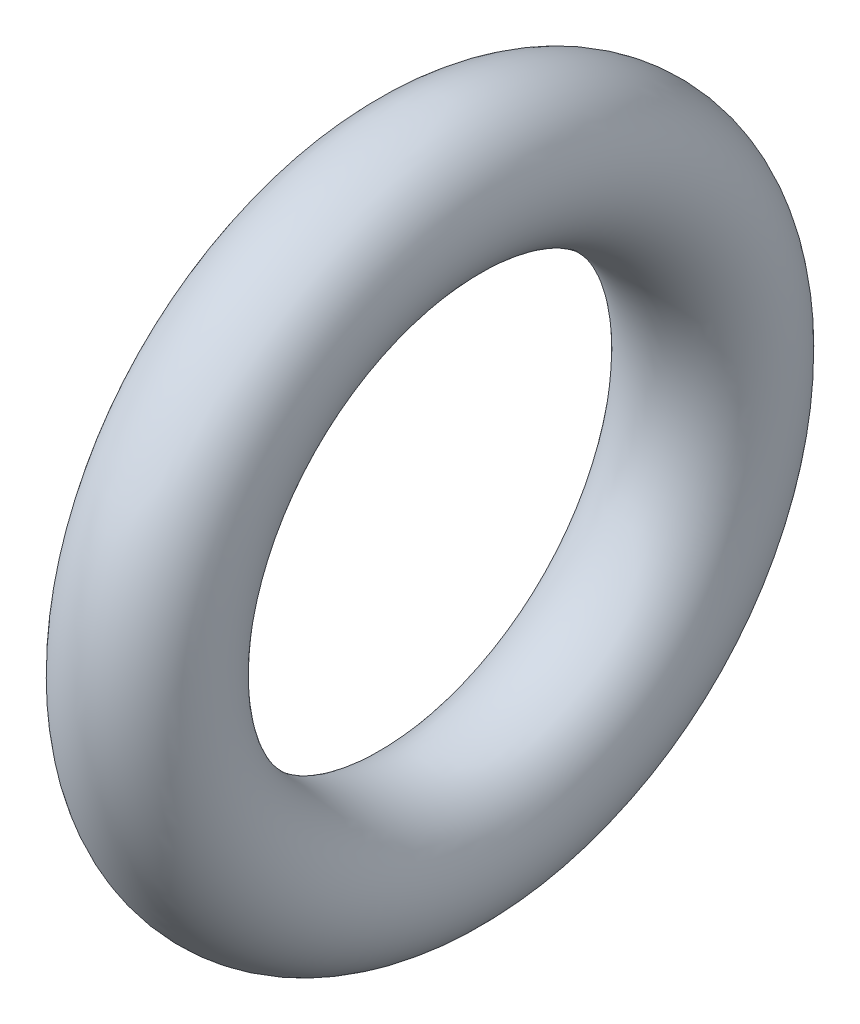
from build123d import *

# Parameters (mm, degrees)
ESQUISSE2_R = 0.89


with BuildPart() as part:
    # Esquisse2 → Base-R_volution (revolve)
    with BuildSketch(Plane.XY, mode=Mode.PRIVATE) as base_r_volution_sk:
        with Locations((0.89, 3.52)):
            Circle(ESQUISSE2_R)
    revolve(base_r_volution_sk.sketch.rotate(Axis((0, 0, 0), (1, 0, 0)), 90), axis=Axis((0, 0, 0), (1, 0, 0)))


solid = part.part
